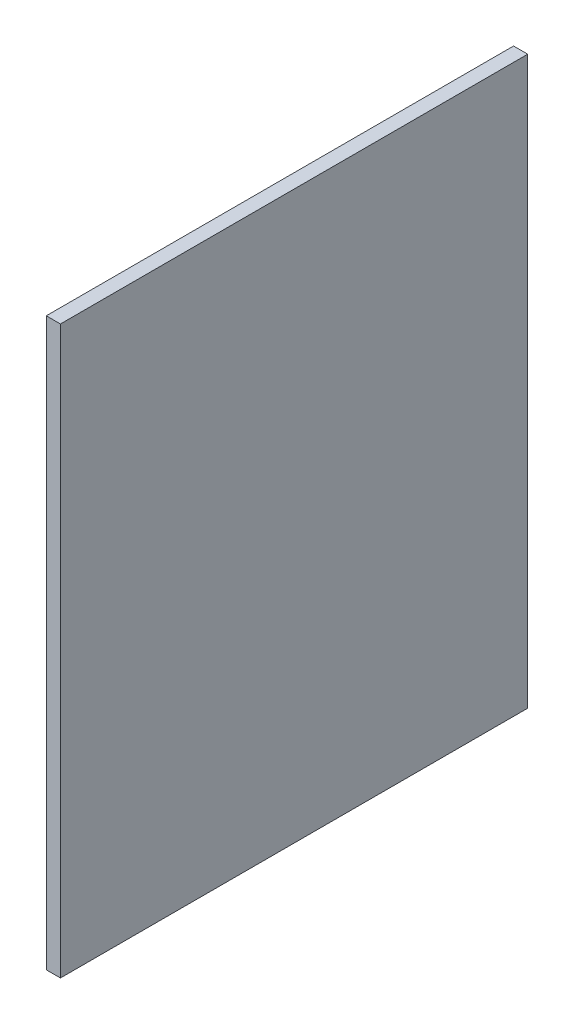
ISO-10303-21;
HEADER;
FILE_DESCRIPTION(('STEP AP214'),'2;1');
FILE_NAME('part.step','',(''),(''),'','','');
FILE_SCHEMA(('AUTOMOTIVE_DESIGN { 1 0 10303 214 1 1 1 1 }'));
ENDSEC;
DATA;
#1=APPLICATION_CONTEXT('core data for automotive mechanical design processes');
#2=APPLICATION_PROTOCOL_DEFINITION('international standard','automotive_design',2000,#1);
#3=PRODUCT_CONTEXT('',#1,'mechanical');
#4=PRODUCT('Part','Part','',(#3));
#5=PRODUCT_RELATED_PRODUCT_CATEGORY('part','',(#4));
#6=PRODUCT_DEFINITION_FORMATION('','',#4);
#7=PRODUCT_DEFINITION_CONTEXT('part definition',#1,'design');
#8=PRODUCT_DEFINITION('design','',#6,#7);
#9=PRODUCT_DEFINITION_SHAPE('','',#8);
#10=(LENGTH_UNIT() NAMED_UNIT(*) SI_UNIT(.MILLI.,.METRE.));
#11=(NAMED_UNIT(*) PLANE_ANGLE_UNIT() SI_UNIT($,.RADIAN.));
#12=(NAMED_UNIT(*) SI_UNIT($,.STERADIAN.) SOLID_ANGLE_UNIT());
#13=UNCERTAINTY_MEASURE_WITH_UNIT(LENGTH_MEASURE(1.E-05),#10,'distance_accuracy_value','');
#14=(GEOMETRIC_REPRESENTATION_CONTEXT(3) GLOBAL_UNCERTAINTY_ASSIGNED_CONTEXT((#13)) GLOBAL_UNIT_ASSIGNED_CONTEXT((#10,
#11,#12)) REPRESENTATION_CONTEXT('',''));
#15=CARTESIAN_POINT('',(0.,0.,0.));
#16=DIRECTION('',(0.,0.,1.));
#17=DIRECTION('',(1.,0.,0.));
#18=AXIS2_PLACEMENT_3D('',#15,#16,#17);
#19=CARTESIAN_POINT('',(12.7,254.,247.65));
#20=DIRECTION('',(0.,0.,-1.));
#21=DIRECTION('',(0.,1.,0.));
#22=AXIS2_PLACEMENT_3D('',#19,#20,#21);
#23=PLANE('',#22);
#24=DIRECTION('',(0.,-1.,0.));
#25=VECTOR('',#24,1.);
#26=CARTESIAN_POINT('',(0.,254.,247.65));
#27=LINE('',#26,#25);
#28=CARTESIAN_POINT('',(0.,254.,247.65));
#29=VERTEX_POINT('',#28);
#30=CARTESIAN_POINT('',(0.,-254.,247.65));
#31=VERTEX_POINT('',#30);
#32=EDGE_CURVE('E94',#29,#31,#27,.T.);
#33=ORIENTED_EDGE('',*,*,#32,.T.);
#34=DIRECTION('',(-1.,0.,0.));
#35=VECTOR('',#34,1.);
#36=CARTESIAN_POINT('',(12.7,-254.,247.65));
#37=LINE('',#36,#35);
#38=CARTESIAN_POINT('',(12.7,-254.,247.65));
#39=VERTEX_POINT('',#38);
#40=EDGE_CURVE('E11',#39,#31,#37,.T.);
#41=ORIENTED_EDGE('',*,*,#40,.F.);
#42=DIRECTION('',(0.,-1.,0.));
#43=VECTOR('',#42,1.);
#44=CARTESIAN_POINT('',(12.7,254.,247.65));
#45=LINE('',#44,#43);
#46=CARTESIAN_POINT('',(12.7,254.,247.65));
#47=VERTEX_POINT('',#46);
#48=EDGE_CURVE('E82',#47,#39,#45,.T.);
#49=ORIENTED_EDGE('',*,*,#48,.F.);
#50=DIRECTION('',(-1.,0.,0.));
#51=VECTOR('',#50,1.);
#52=CARTESIAN_POINT('',(12.7,254.,247.65));
#53=LINE('',#52,#51);
#54=EDGE_CURVE('E90',#47,#29,#53,.T.);
#55=ORIENTED_EDGE('',*,*,#54,.T.);
#56=EDGE_LOOP('',(#33,#41,#49,#55));
#57=FACE_BOUND('',#56,.T.);
#58=ADVANCED_FACE('F31',(#57),#23,.F.);
#59=CARTESIAN_POINT('',(12.7,-254.,247.65));
#60=DIRECTION('',(0.,1.,0.));
#61=DIRECTION('',(0.,0.,1.));
#62=AXIS2_PLACEMENT_3D('',#59,#60,#61);
#63=PLANE('',#62);
#64=DIRECTION('',(0.,0.,-1.));
#65=VECTOR('',#64,1.);
#66=CARTESIAN_POINT('',(0.,-254.,247.65));
#67=LINE('',#66,#65);
#68=CARTESIAN_POINT('',(0.,-254.,-171.45));
#69=VERTEX_POINT('',#68);
#70=EDGE_CURVE('E86',#31,#69,#67,.T.);
#71=ORIENTED_EDGE('',*,*,#70,.T.);
#72=DIRECTION('',(-1.,0.,0.));
#73=VECTOR('',#72,1.);
#74=CARTESIAN_POINT('',(12.7,-254.,-171.45));
#75=LINE('',#74,#73);
#76=CARTESIAN_POINT('',(12.7,-254.,-171.45));
#77=VERTEX_POINT('',#76);
#78=EDGE_CURVE('E39',#77,#69,#75,.T.);
#79=ORIENTED_EDGE('',*,*,#78,.F.);
#80=DIRECTION('',(0.,0.,-1.));
#81=VECTOR('',#80,1.);
#82=CARTESIAN_POINT('',(12.7,-254.,247.65));
#83=LINE('',#82,#81);
#84=EDGE_CURVE('E77',#39,#77,#83,.T.);
#85=ORIENTED_EDGE('',*,*,#84,.F.);
#86=ORIENTED_EDGE('',*,*,#40,.T.);
#87=EDGE_LOOP('',(#71,#79,#85,#86));
#88=FACE_BOUND('',#87,.T.);
#89=ADVANCED_FACE('F85',(#88),#63,.F.);
#90=CARTESIAN_POINT('',(12.7,254.,-171.45));
#91=DIRECTION('',(0.,0.,1.));
#92=DIRECTION('',(0.,-1.,0.));
#93=AXIS2_PLACEMENT_3D('',#90,#91,#92);
#94=PLANE('',#93);
#95=DIRECTION('',(0.,1.,0.));
#96=VECTOR('',#95,1.);
#97=CARTESIAN_POINT('',(0.,254.,-171.45));
#98=LINE('',#97,#96);
#99=CARTESIAN_POINT('',(0.,254.,-171.45));
#100=VERTEX_POINT('',#99);
#101=EDGE_CURVE('E64',#69,#100,#98,.T.);
#102=ORIENTED_EDGE('',*,*,#101,.T.);
#103=DIRECTION('',(-1.,0.,0.));
#104=VECTOR('',#103,1.);
#105=CARTESIAN_POINT('',(12.7,254.,-171.45));
#106=LINE('',#105,#104);
#107=CARTESIAN_POINT('',(12.7,254.,-171.45));
#108=VERTEX_POINT('',#107);
#109=EDGE_CURVE('E87',#108,#100,#106,.T.);
#110=ORIENTED_EDGE('',*,*,#109,.F.);
#111=DIRECTION('',(0.,1.,0.));
#112=VECTOR('',#111,1.);
#113=CARTESIAN_POINT('',(12.7,254.,-171.45));
#114=LINE('',#113,#112);
#115=EDGE_CURVE('E80',#77,#108,#114,.T.);
#116=ORIENTED_EDGE('',*,*,#115,.F.);
#117=ORIENTED_EDGE('',*,*,#78,.T.);
#118=EDGE_LOOP('',(#102,#110,#116,#117));
#119=FACE_BOUND('',#118,.T.);
#120=ADVANCED_FACE('F88',(#119),#94,.F.);
#121=CARTESIAN_POINT('',(12.7,254.,247.65));
#122=DIRECTION('',(0.,-1.,0.));
#123=DIRECTION('',(0.,0.,-1.));
#124=AXIS2_PLACEMENT_3D('',#121,#122,#123);
#125=PLANE('',#124);
#126=DIRECTION('',(0.,0.,1.));
#127=VECTOR('',#126,1.);
#128=CARTESIAN_POINT('',(0.,254.,247.65));
#129=LINE('',#128,#127);
#130=EDGE_CURVE('E70',#100,#29,#129,.T.);
#131=ORIENTED_EDGE('',*,*,#130,.T.);
#132=ORIENTED_EDGE('',*,*,#54,.F.);
#133=DIRECTION('',(0.,0.,1.));
#134=VECTOR('',#133,1.);
#135=CARTESIAN_POINT('',(12.7,254.,247.65));
#136=LINE('',#135,#134);
#137=EDGE_CURVE('E47',#108,#47,#136,.T.);
#138=ORIENTED_EDGE('',*,*,#137,.F.);
#139=ORIENTED_EDGE('',*,*,#109,.T.);
#140=EDGE_LOOP('',(#131,#132,#138,#139));
#141=FACE_BOUND('',#140,.T.);
#142=ADVANCED_FACE('F101',(#141),#125,.F.);
#143=CARTESIAN_POINT('',(12.7,-254.,247.65));
#144=DIRECTION('',(1.,0.,0.));
#145=DIRECTION('',(0.,0.,-1.));
#146=AXIS2_PLACEMENT_3D('',#143,#144,#145);
#147=PLANE('',#146);
#148=ORIENTED_EDGE('',*,*,#48,.T.);
#149=ORIENTED_EDGE('',*,*,#84,.T.);
#150=ORIENTED_EDGE('',*,*,#115,.T.);
#151=ORIENTED_EDGE('',*,*,#137,.T.);
#152=EDGE_LOOP('',(#148,#149,#150,#151));
#153=FACE_BOUND('',#152,.T.);
#154=ADVANCED_FACE('F78',(#153),#147,.T.);
#155=CARTESIAN_POINT('',(0.,-254.,247.65));
#156=DIRECTION('',(1.,0.,0.));
#157=DIRECTION('',(0.,0.,-1.));
#158=AXIS2_PLACEMENT_3D('',#155,#156,#157);
#159=PLANE('',#158);
#160=ORIENTED_EDGE('',*,*,#32,.F.);
#161=ORIENTED_EDGE('',*,*,#130,.F.);
#162=ORIENTED_EDGE('',*,*,#101,.F.);
#163=ORIENTED_EDGE('',*,*,#70,.F.);
#164=EDGE_LOOP('',(#160,#161,#162,#163));
#165=FACE_BOUND('',#164,.T.);
#166=ADVANCED_FACE('F104',(#165),#159,.F.);
#167=CLOSED_SHELL('',(#58,#89,#120,#142,#154,#166));
#168=MANIFOLD_SOLID_BREP('B2',#167);
#169=ADVANCED_BREP_SHAPE_REPRESENTATION('',(#18,#168),#14);
#170=SHAPE_DEFINITION_REPRESENTATION(#9,#169);
ENDSEC;
END-ISO-10303-21;
